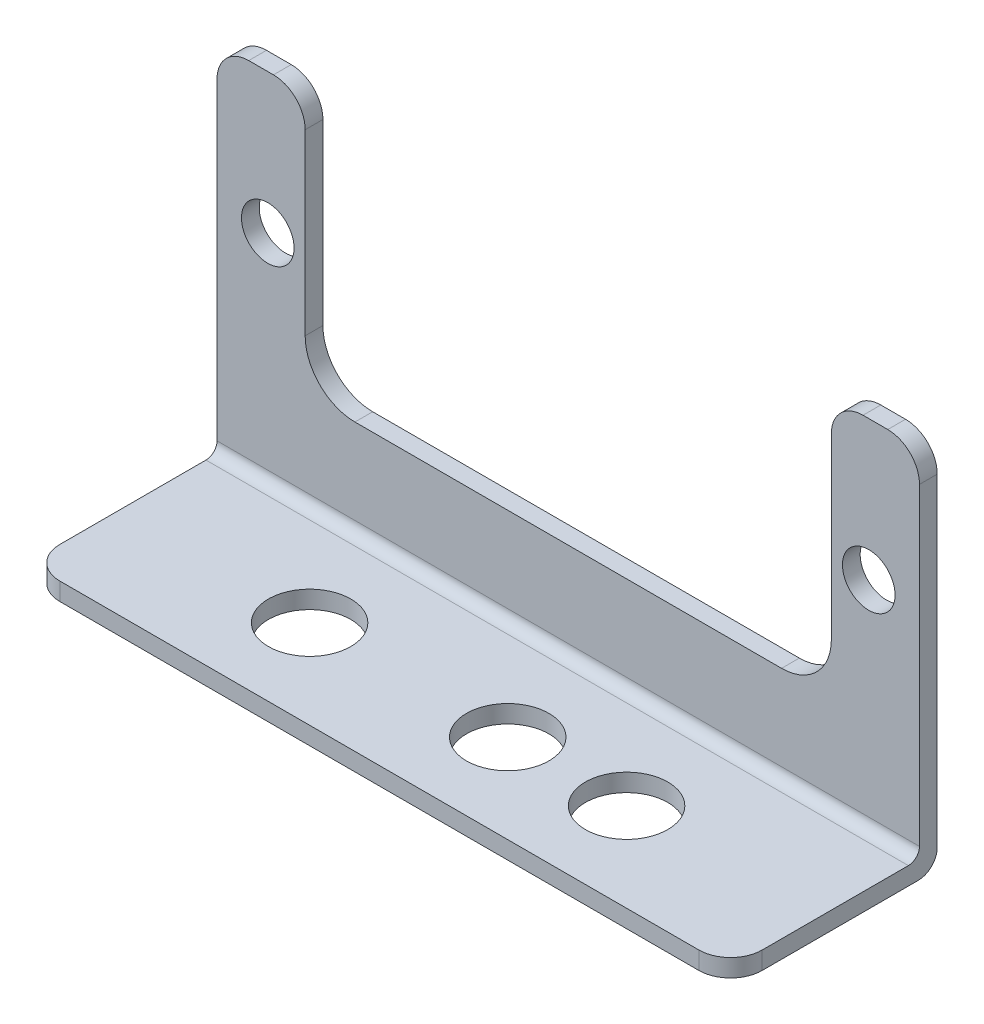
ISO-10303-21;
HEADER;
FILE_DESCRIPTION(('STEP AP214'),'2;1');
FILE_NAME('part.step','',(''),(''),'','','');
FILE_SCHEMA(('AUTOMOTIVE_DESIGN { 1 0 10303 214 1 1 1 1 }'));
ENDSEC;
DATA;
#1=APPLICATION_CONTEXT('core data for automotive mechanical design processes');
#2=APPLICATION_PROTOCOL_DEFINITION('international standard','automotive_design',2000,#1);
#3=PRODUCT_CONTEXT('',#1,'mechanical');
#4=PRODUCT('Part','Part','',(#3));
#5=PRODUCT_RELATED_PRODUCT_CATEGORY('part','',(#4));
#6=PRODUCT_DEFINITION_FORMATION('','',#4);
#7=PRODUCT_DEFINITION_CONTEXT('part definition',#1,'design');
#8=PRODUCT_DEFINITION('design','',#6,#7);
#9=PRODUCT_DEFINITION_SHAPE('','',#8);
#10=(LENGTH_UNIT() NAMED_UNIT(*) SI_UNIT(.MILLI.,.METRE.));
#11=(NAMED_UNIT(*) PLANE_ANGLE_UNIT() SI_UNIT($,.RADIAN.));
#12=(NAMED_UNIT(*) SI_UNIT($,.STERADIAN.) SOLID_ANGLE_UNIT());
#13=UNCERTAINTY_MEASURE_WITH_UNIT(LENGTH_MEASURE(1.E-05),#10,'distance_accuracy_value','');
#14=(GEOMETRIC_REPRESENTATION_CONTEXT(3) GLOBAL_UNCERTAINTY_ASSIGNED_CONTEXT((#13)) GLOBAL_UNIT_ASSIGNED_CONTEXT((#10,
#11,#12)) REPRESENTATION_CONTEXT('',''));
#15=CARTESIAN_POINT('',(0.,0.,0.));
#16=DIRECTION('',(0.,0.,1.));
#17=DIRECTION('',(1.,0.,0.));
#18=AXIS2_PLACEMENT_3D('',#15,#16,#17);
#19=CARTESIAN_POINT('',(56.2863999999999,29.9720000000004,0.));
#20=DIRECTION('',(0.,-1.,0.));
#21=DIRECTION('',(0.,0.,-1.));
#22=AXIS2_PLACEMENT_3D('',#19,#20,#21);
#23=PLANE('',#22);
#24=DIRECTION('',(-1.,0.,0.));
#25=VECTOR('',#24,1.);
#26=CARTESIAN_POINT('',(56.2863999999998,29.9720000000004,1.42240000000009));
#27=LINE('',#26,#25);
#28=CARTESIAN_POINT('',(4.5212,29.972,1.42239999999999));
#29=VERTEX_POINT('',#28);
#30=CARTESIAN_POINT('',(2.54,29.972,1.42239999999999));
#31=VERTEX_POINT('',#30);
#32=EDGE_CURVE('E289',#29,#31,#27,.T.);
#33=ORIENTED_EDGE('',*,*,#32,.F.);
#34=DIRECTION('',(0.,0.,1.));
#35=VECTOR('',#34,1.);
#36=CARTESIAN_POINT('',(4.5212,29.972,0.));
#37=LINE('',#36,#35);
#38=CARTESIAN_POINT('',(4.5212,29.972,0.));
#39=VERTEX_POINT('',#38);
#40=EDGE_CURVE('E336',#29,#39,#37,.F.);
#41=ORIENTED_EDGE('',*,*,#40,.T.);
#42=DIRECTION('',(-1.,0.,0.));
#43=VECTOR('',#42,1.);
#44=CARTESIAN_POINT('',(56.2863999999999,29.9720000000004,0.));
#45=LINE('',#44,#43);
#46=CARTESIAN_POINT('',(2.54,29.972,0.));
#47=VERTEX_POINT('',#46);
#48=EDGE_CURVE('E293',#39,#47,#45,.T.);
#49=ORIENTED_EDGE('',*,*,#48,.T.);
#50=DIRECTION('',(0.,0.,1.));
#51=VECTOR('',#50,1.);
#52=CARTESIAN_POINT('',(2.54,29.972,0.));
#53=LINE('',#52,#51);
#54=EDGE_CURVE('E333',#47,#31,#53,.T.);
#55=ORIENTED_EDGE('',*,*,#54,.T.);
#56=EDGE_LOOP('',(#33,#41,#49,#55));
#57=FACE_BOUND('',#56,.T.);
#58=ADVANCED_FACE('F44',(#57),#23,.F.);
#59=CARTESIAN_POINT('',(56.2864,0.,16.5608000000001));
#60=DIRECTION('',(0.,0.,-1.));
#61=DIRECTION('',(-1.,0.,0.));
#62=AXIS2_PLACEMENT_3D('',#59,#60,#61);
#63=PLANE('',#62);
#64=DIRECTION('',(-1.,0.,0.));
#65=VECTOR('',#64,1.);
#66=CARTESIAN_POINT('',(56.2864,0.,16.5608000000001));
#67=LINE('',#66,#65);
#68=CARTESIAN_POINT('',(53.7464,0.,16.5608));
#69=VERTEX_POINT('',#68);
#70=CARTESIAN_POINT('',(2.53999999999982,-3.60822483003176E-13,16.5608));
#71=VERTEX_POINT('',#70);
#72=EDGE_CURVE('E303',#69,#71,#67,.T.);
#73=ORIENTED_EDGE('',*,*,#72,.F.);
#74=DIRECTION('',(0.,-1.,0.));
#75=VECTOR('',#74,1.);
#76=CARTESIAN_POINT('',(53.7464,1.4224,16.5608));
#77=LINE('',#76,#75);
#78=CARTESIAN_POINT('',(53.7464,1.4224,16.5608));
#79=VERTEX_POINT('',#78);
#80=EDGE_CURVE('E351',#69,#79,#77,.F.);
#81=ORIENTED_EDGE('',*,*,#80,.T.);
#82=DIRECTION('',(-1.,0.,0.));
#83=VECTOR('',#82,1.);
#84=CARTESIAN_POINT('',(56.2864,1.4224,16.5608000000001));
#85=LINE('',#84,#83);
#86=CARTESIAN_POINT('',(2.53999999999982,1.42239999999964,16.5608));
#87=VERTEX_POINT('',#86);
#88=EDGE_CURVE('E270',#79,#87,#85,.T.);
#89=ORIENTED_EDGE('',*,*,#88,.T.);
#90=DIRECTION('',(0.,-1.,0.));
#91=VECTOR('',#90,1.);
#92=CARTESIAN_POINT('',(2.53999999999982,-3.60822483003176E-13,16.5608));
#93=LINE('',#92,#91);
#94=EDGE_CURVE('E348',#87,#71,#93,.T.);
#95=ORIENTED_EDGE('',*,*,#94,.T.);
#96=EDGE_LOOP('',(#73,#81,#89,#95));
#97=FACE_BOUND('',#96,.T.);
#98=ADVANCED_FACE('F370',(#97),#63,.F.);
#99=CARTESIAN_POINT('',(56.2864,3.60822483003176E-13,1.52400000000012));
#100=DIRECTION('',(0.,1.,0.));
#101=DIRECTION('',(0.,0.,1.));
#102=AXIS2_PLACEMENT_3D('',#99,#100,#101);
#103=PLANE('',#102);
#104=CARTESIAN_POINT('',(31.3182000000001,0.,9.44880000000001));
#105=DIRECTION('',(0.,1.,0.));
#106=DIRECTION('',(0.,0.,1.));
#107=AXIS2_PLACEMENT_3D('',#104,#105,#106);
#108=CIRCLE('',#107,3.302);
#109=CARTESIAN_POINT('',(31.3182000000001,0.,12.7508));
#110=VERTEX_POINT('',#109);
#111=EDGE_CURVE('E237',#110,#110,#108,.T.);
#112=ORIENTED_EDGE('',*,*,#111,.T.);
#113=EDGE_LOOP('',(#112));
#114=FACE_BOUND('',#113,.T.);
#115=CARTESIAN_POINT('',(40.8432000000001,3.60822483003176E-13,9.44880000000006));
#116=DIRECTION('',(0.,1.,0.));
#117=DIRECTION('',(0.,0.,1.));
#118=AXIS2_PLACEMENT_3D('',#115,#116,#117);
#119=CIRCLE('',#118,3.302);
#120=CARTESIAN_POINT('',(40.8432000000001,3.60420497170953E-13,12.7508000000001));
#121=VERTEX_POINT('',#120);
#122=EDGE_CURVE('E243',#121,#121,#119,.T.);
#123=ORIENTED_EDGE('',*,*,#122,.T.);
#124=EDGE_LOOP('',(#123));
#125=FACE_BOUND('',#124,.T.);
#126=CARTESIAN_POINT('',(15.4432,0.,9.44880000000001));
#127=DIRECTION('',(0.,1.,0.));
#128=DIRECTION('',(0.,0.,1.));
#129=AXIS2_PLACEMENT_3D('',#126,#127,#128);
#130=CIRCLE('',#129,3.302);
#131=CARTESIAN_POINT('',(15.4432,0.,12.7508));
#132=VERTEX_POINT('',#131);
#133=EDGE_CURVE('E249',#132,#132,#130,.T.);
#134=ORIENTED_EDGE('',*,*,#133,.T.);
#135=EDGE_LOOP('',(#134));
#136=FACE_BOUND('',#135,.T.);
#137=DIRECTION('',(0.,0.,-1.));
#138=VECTOR('',#137,1.);
#139=CARTESIAN_POINT('',(56.2864,3.60822483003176E-13,1.52400000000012));
#140=LINE('',#139,#138);
#141=CARTESIAN_POINT('',(56.2863999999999,3.60822483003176E-13,14.0208000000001));
#142=VERTEX_POINT('',#141);
#143=CARTESIAN_POINT('',(56.2864,3.60822483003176E-13,1.52400000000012));
#144=VERTEX_POINT('',#143);
#145=EDGE_CURVE('E255',#142,#144,#140,.T.);
#146=ORIENTED_EDGE('',*,*,#145,.F.);
#147=CARTESIAN_POINT('',(53.7464,0.,14.0208));
#148=DIRECTION('',(0.,1.,0.));
#149=DIRECTION('',(0.,0.,1.));
#150=AXIS2_PLACEMENT_3D('',#147,#148,#149);
#151=CIRCLE('',#150,2.54);
#152=EDGE_CURVE('E346',#142,#69,#151,.F.);
#153=ORIENTED_EDGE('',*,*,#152,.T.);
#154=ORIENTED_EDGE('',*,*,#72,.T.);
#155=CARTESIAN_POINT('',(2.54,0.,14.0208));
#156=DIRECTION('',(0.,1.,0.));
#157=DIRECTION('',(0.,0.,1.));
#158=AXIS2_PLACEMENT_3D('',#155,#156,#157);
#159=CIRCLE('',#158,2.54);
#160=CARTESIAN_POINT('',(0.,0.,14.0208));
#161=VERTEX_POINT('',#160);
#162=EDGE_CURVE('E344',#71,#161,#159,.F.);
#163=ORIENTED_EDGE('',*,*,#162,.T.);
#164=DIRECTION('',(0.,0.,-1.));
#165=VECTOR('',#164,1.);
#166=CARTESIAN_POINT('',(0.,0.,1.524));
#167=LINE('',#166,#165);
#168=CARTESIAN_POINT('',(0.,0.,1.524));
#169=VERTEX_POINT('',#168);
#170=EDGE_CURVE('E252',#161,#169,#167,.T.);
#171=ORIENTED_EDGE('',*,*,#170,.T.);
#172=DIRECTION('',(-1.,0.,0.));
#173=VECTOR('',#172,1.);
#174=CARTESIAN_POINT('',(56.2864,3.60822483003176E-13,1.52400000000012));
#175=LINE('',#174,#173);
#176=EDGE_CURVE('E300',#144,#169,#175,.T.);
#177=ORIENTED_EDGE('',*,*,#176,.F.);
#178=EDGE_LOOP('',(#146,#153,#154,#163,#171,#177));
#179=FACE_BOUND('',#178,.T.);
#180=ADVANCED_FACE('F367',(#114,#125,#136,#179),#103,.F.);
#181=CARTESIAN_POINT('',(56.2864,1.52400000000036,1.52400000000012));
#182=DIRECTION('',(-1.,0.,0.));
#183=DIRECTION('',(0.,0.,1.));
#184=AXIS2_PLACEMENT_3D('',#181,#182,#183);
#185=CYLINDRICAL_SURFACE('',#184,1.524);
#186=CARTESIAN_POINT('',(0.,1.524,1.524));
#187=DIRECTION('',(1.,0.,0.));
#188=DIRECTION('',(0.,0.,1.));
#189=AXIS2_PLACEMENT_3D('',#186,#187,#188);
#190=CIRCLE('',#189,1.524);
#191=CARTESIAN_POINT('',(0.,1.52400000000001,0.));
#192=VERTEX_POINT('',#191);
#193=EDGE_CURVE('E272',#169,#192,#190,.T.);
#194=ORIENTED_EDGE('',*,*,#193,.T.);
#195=DIRECTION('',(-1.,0.,0.));
#196=VECTOR('',#195,1.);
#197=CARTESIAN_POINT('',(56.2864,1.52400000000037,0.));
#198=LINE('',#197,#196);
#199=CARTESIAN_POINT('',(56.2864,1.52400000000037,0.));
#200=VERTEX_POINT('',#199);
#201=EDGE_CURVE('E297',#200,#192,#198,.T.);
#202=ORIENTED_EDGE('',*,*,#201,.F.);
#203=CARTESIAN_POINT('',(56.2864,1.52400000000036,1.52400000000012));
#204=DIRECTION('',(1.,0.,0.));
#205=DIRECTION('',(0.,0.,1.));
#206=AXIS2_PLACEMENT_3D('',#203,#204,#205);
#207=CIRCLE('',#206,1.524);
#208=EDGE_CURVE('E257',#144,#200,#207,.T.);
#209=ORIENTED_EDGE('',*,*,#208,.F.);
#210=ORIENTED_EDGE('',*,*,#176,.T.);
#211=EDGE_LOOP('',(#194,#202,#209,#210));
#212=FACE_BOUND('',#211,.T.);
#213=ADVANCED_FACE('F378',(#212),#185,.T.);
#214=CARTESIAN_POINT('',(56.2864,1.52400000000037,0.));
#215=DIRECTION('',(0.,0.,1.));
#216=DIRECTION('',(1.,0.,0.));
#217=AXIS2_PLACEMENT_3D('',#214,#215,#216);
#218=PLANE('',#217);
#219=CARTESIAN_POINT('',(52.2224,18.7706,0.));
#220=DIRECTION('',(0.,0.,1.));
#221=DIRECTION('',(1.,0.,0.));
#222=AXIS2_PLACEMENT_3D('',#219,#220,#221);
#223=CIRCLE('',#222,2.1082);
#224=CARTESIAN_POINT('',(54.3306,18.7706,0.));
#225=VERTEX_POINT('',#224);
#226=EDGE_CURVE('E678',#225,#225,#223,.T.);
#227=ORIENTED_EDGE('',*,*,#226,.T.);
#228=EDGE_LOOP('',(#227));
#229=FACE_BOUND('',#228,.T.);
#230=CARTESIAN_POINT('',(4.064,18.7706,0.));
#231=DIRECTION('',(0.,0.,1.));
#232=DIRECTION('',(1.,0.,0.));
#233=AXIS2_PLACEMENT_3D('',#230,#231,#232);
#234=CIRCLE('',#233,2.1082);
#235=CARTESIAN_POINT('',(6.1722,18.7706,0.));
#236=VERTEX_POINT('',#235);
#237=EDGE_CURVE('E224',#236,#236,#234,.T.);
#238=ORIENTED_EDGE('',*,*,#237,.T.);
#239=EDGE_LOOP('',(#238));
#240=FACE_BOUND('',#239,.T.);
#241=CARTESIAN_POINT('',(53.7464,29.972,0.));
#242=VERTEX_POINT('',#241);
#243=CARTESIAN_POINT('',(51.7651999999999,29.972,0.));
#244=VERTEX_POINT('',#243);
#245=EDGE_CURVE('E296',#242,#244,#45,.T.);
#246=ORIENTED_EDGE('',*,*,#245,.F.);
#247=CARTESIAN_POINT('',(53.7464,27.432,0.));
#248=DIRECTION('',(0.,0.,1.));
#249=DIRECTION('',(1.,0.,0.));
#250=AXIS2_PLACEMENT_3D('',#247,#248,#249);
#251=CIRCLE('',#250,2.54);
#252=CARTESIAN_POINT('',(56.2864,27.4320000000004,0.));
#253=VERTEX_POINT('',#252);
#254=EDGE_CURVE('E328',#242,#253,#251,.F.);
#255=ORIENTED_EDGE('',*,*,#254,.T.);
#256=DIRECTION('',(0.,1.,0.));
#257=VECTOR('',#256,1.);
#258=CARTESIAN_POINT('',(56.2864,1.52400000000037,0.));
#259=LINE('',#258,#257);
#260=EDGE_CURVE('E260',#200,#253,#259,.T.);
#261=ORIENTED_EDGE('',*,*,#260,.F.);
#262=ORIENTED_EDGE('',*,*,#201,.T.);
#263=DIRECTION('',(0.,1.,0.));
#264=VECTOR('',#263,1.);
#265=CARTESIAN_POINT('',(0.,1.52400000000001,0.));
#266=LINE('',#265,#264);
#267=CARTESIAN_POINT('',(0.,27.432,0.));
#268=VERTEX_POINT('',#267);
#269=EDGE_CURVE('E274',#192,#268,#266,.T.);
#270=ORIENTED_EDGE('',*,*,#269,.T.);
#271=CARTESIAN_POINT('',(2.54,27.432,0.));
#272=DIRECTION('',(0.,0.,1.));
#273=DIRECTION('',(1.,0.,0.));
#274=AXIS2_PLACEMENT_3D('',#271,#272,#273);
#275=CIRCLE('',#274,2.54);
#276=EDGE_CURVE('E322',#268,#47,#275,.F.);
#277=ORIENTED_EDGE('',*,*,#276,.T.);
#278=ORIENTED_EDGE('',*,*,#48,.F.);
#279=CARTESIAN_POINT('',(4.5212,27.432,0.));
#280=DIRECTION('',(0.,0.,1.));
#281=DIRECTION('',(1.,0.,0.));
#282=AXIS2_PLACEMENT_3D('',#279,#280,#281);
#283=CIRCLE('',#282,2.54);
#284=CARTESIAN_POINT('',(7.0612,27.432,0.));
#285=VERTEX_POINT('',#284);
#286=EDGE_CURVE('E326',#39,#285,#283,.F.);
#287=ORIENTED_EDGE('',*,*,#286,.T.);
#288=DIRECTION('',(0.,-1.,0.));
#289=VECTOR('',#288,1.);
#290=CARTESIAN_POINT('',(7.0612,13.1318000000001,0.));
#291=LINE('',#290,#289);
#292=CARTESIAN_POINT('',(7.0612,13.1318000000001,0.));
#293=VERTEX_POINT('',#292);
#294=EDGE_CURVE('E203',#285,#293,#291,.T.);
#295=ORIENTED_EDGE('',*,*,#294,.T.);
#296=CARTESIAN_POINT('',(11.049,13.1318000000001,0.));
#297=DIRECTION('',(0.,0.,1.));
#298=DIRECTION('',(-1.,0.,0.));
#299=AXIS2_PLACEMENT_3D('',#296,#297,#298);
#300=CIRCLE('',#299,3.9878);
#301=CARTESIAN_POINT('',(11.049,9.14400000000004,0.));
#302=VERTEX_POINT('',#301);
#303=EDGE_CURVE('E219',#293,#302,#300,.T.);
#304=ORIENTED_EDGE('',*,*,#303,.T.);
#305=DIRECTION('',(1.,0.,0.));
#306=VECTOR('',#305,1.);
#307=CARTESIAN_POINT('',(28.1432,9.144,0.));
#308=LINE('',#307,#306);
#309=CARTESIAN_POINT('',(45.2374,9.144,0.));
#310=VERTEX_POINT('',#309);
#311=EDGE_CURVE('E194',#302,#310,#308,.T.);
#312=ORIENTED_EDGE('',*,*,#311,.T.);
#313=CARTESIAN_POINT('',(45.2374,13.1318,0.));
#314=DIRECTION('',(0.,0.,1.));
#315=DIRECTION('',(-1.,0.,0.));
#316=AXIS2_PLACEMENT_3D('',#313,#314,#315);
#317=CIRCLE('',#316,3.9878);
#318=CARTESIAN_POINT('',(49.2252,13.1318,0.));
#319=VERTEX_POINT('',#318);
#320=EDGE_CURVE('E186',#310,#319,#317,.T.);
#321=ORIENTED_EDGE('',*,*,#320,.T.);
#322=DIRECTION('',(0.,1.,0.));
#323=VECTOR('',#322,1.);
#324=CARTESIAN_POINT('',(49.2252,29.972,0.));
#325=LINE('',#324,#323);
#326=CARTESIAN_POINT('',(49.2252,27.432,0.));
#327=VERTEX_POINT('',#326);
#328=EDGE_CURVE('E197',#319,#327,#325,.T.);
#329=ORIENTED_EDGE('',*,*,#328,.T.);
#330=CARTESIAN_POINT('',(51.7652,27.432,0.));
#331=DIRECTION('',(0.,0.,1.));
#332=DIRECTION('',(1.,0.,0.));
#333=AXIS2_PLACEMENT_3D('',#330,#331,#332);
#334=CIRCLE('',#333,2.54);
#335=EDGE_CURVE('E324',#327,#244,#334,.F.);
#336=ORIENTED_EDGE('',*,*,#335,.T.);
#337=EDGE_LOOP('',(#246,#255,#261,#262,#270,#277,#278,#287,#295,#304,#312,#321,#329,#336));
#338=FACE_BOUND('',#337,.T.);
#339=ADVANCED_FACE('F206',(#229,#240,#338),#218,.F.);
#340=CARTESIAN_POINT('',(53.7463999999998,29.972,1.42240000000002));
#341=VERTEX_POINT('',#340);
#342=CARTESIAN_POINT('',(51.7651999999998,29.972,1.42240000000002));
#343=VERTEX_POINT('',#342);
#344=EDGE_CURVE('E290',#341,#343,#27,.T.);
#345=ORIENTED_EDGE('',*,*,#344,.F.);
#346=DIRECTION('',(0.,0.,1.));
#347=VECTOR('',#346,1.);
#348=CARTESIAN_POINT('',(53.7464,29.972,0.));
#349=LINE('',#348,#347);
#350=EDGE_CURVE('E320',#341,#242,#349,.F.);
#351=ORIENTED_EDGE('',*,*,#350,.T.);
#352=ORIENTED_EDGE('',*,*,#245,.T.);
#353=DIRECTION('',(0.,0.,1.));
#354=VECTOR('',#353,1.);
#355=CARTESIAN_POINT('',(51.7651999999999,29.972,0.));
#356=LINE('',#355,#354);
#357=EDGE_CURVE('E317',#244,#343,#356,.T.);
#358=ORIENTED_EDGE('',*,*,#357,.T.);
#359=EDGE_LOOP('',(#345,#351,#352,#358));
#360=FACE_BOUND('',#359,.T.);
#361=ADVANCED_FACE('F393',(#360),#23,.F.);
#362=CARTESIAN_POINT('',(56.2863999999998,29.9720000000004,1.42240000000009));
#363=DIRECTION('',(0.,0.,-1.));
#364=DIRECTION('',(-1.,0.,0.));
#365=AXIS2_PLACEMENT_3D('',#362,#363,#364);
#366=PLANE('',#365);
#367=CARTESIAN_POINT('',(52.2223999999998,18.7706,1.42239999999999));
#368=DIRECTION('',(0.,0.,1.));
#369=DIRECTION('',(1.,0.,0.));
#370=AXIS2_PLACEMENT_3D('',#367,#368,#369);
#371=CIRCLE('',#370,2.1082);
#372=CARTESIAN_POINT('',(54.3305999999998,18.7706,1.42239999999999));
#373=VERTEX_POINT('',#372);
#374=EDGE_CURVE('E679',#373,#373,#371,.T.);
#375=ORIENTED_EDGE('',*,*,#374,.F.);
#376=EDGE_LOOP('',(#375));
#377=FACE_BOUND('',#376,.T.);
#378=CARTESIAN_POINT('',(4.064,18.7706,1.42240000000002));
#379=DIRECTION('',(0.,0.,1.));
#380=DIRECTION('',(1.,0.,0.));
#381=AXIS2_PLACEMENT_3D('',#378,#379,#380);
#382=CIRCLE('',#381,2.1082);
#383=CARTESIAN_POINT('',(6.1722,18.7706,1.42240000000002));
#384=VERTEX_POINT('',#383);
#385=EDGE_CURVE('E215',#384,#384,#382,.T.);
#386=ORIENTED_EDGE('',*,*,#385,.F.);
#387=EDGE_LOOP('',(#386));
#388=FACE_BOUND('',#387,.T.);
#389=DIRECTION('',(0.,-1.,0.));
#390=VECTOR('',#389,1.);
#391=CARTESIAN_POINT('',(56.2863999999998,29.9720000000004,1.42240000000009));
#392=LINE('',#391,#390);
#393=CARTESIAN_POINT('',(56.2863999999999,27.4320000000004,1.42240000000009));
#394=VERTEX_POINT('',#393);
#395=CARTESIAN_POINT('',(56.2863999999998,2.31140000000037,1.42240000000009));
#396=VERTEX_POINT('',#395);
#397=EDGE_CURVE('E263',#394,#396,#392,.T.);
#398=ORIENTED_EDGE('',*,*,#397,.F.);
#399=CARTESIAN_POINT('',(53.7463999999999,27.432,1.42240000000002));
#400=DIRECTION('',(0.,0.,-1.));
#401=DIRECTION('',(-1.,0.,0.));
#402=AXIS2_PLACEMENT_3D('',#399,#400,#401);
#403=CIRCLE('',#402,2.54);
#404=EDGE_CURVE('E315',#394,#341,#403,.F.);
#405=ORIENTED_EDGE('',*,*,#404,.T.);
#406=ORIENTED_EDGE('',*,*,#344,.T.);
#407=CARTESIAN_POINT('',(51.7651999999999,27.432,1.42240000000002));
#408=DIRECTION('',(0.,0.,-1.));
#409=DIRECTION('',(-1.,0.,0.));
#410=AXIS2_PLACEMENT_3D('',#407,#408,#409);
#411=CIRCLE('',#410,2.54);
#412=CARTESIAN_POINT('',(49.2251999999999,27.432,1.42240000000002));
#413=VERTEX_POINT('',#412);
#414=EDGE_CURVE('E311',#343,#413,#411,.F.);
#415=ORIENTED_EDGE('',*,*,#414,.T.);
#416=DIRECTION('',(0.,1.,0.));
#417=VECTOR('',#416,1.);
#418=CARTESIAN_POINT('',(49.2251999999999,29.9720000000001,1.42240000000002));
#419=LINE('',#418,#417);
#420=CARTESIAN_POINT('',(49.2251999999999,13.1318000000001,1.42240000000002));
#421=VERTEX_POINT('',#420);
#422=EDGE_CURVE('E223',#421,#413,#419,.T.);
#423=ORIENTED_EDGE('',*,*,#422,.F.);
#424=CARTESIAN_POINT('',(45.2373999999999,13.1318000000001,1.42240000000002));
#425=DIRECTION('',(0.,0.,1.));
#426=DIRECTION('',(-1.,0.,0.));
#427=AXIS2_PLACEMENT_3D('',#424,#425,#426);
#428=CIRCLE('',#427,3.9878);
#429=CARTESIAN_POINT('',(45.2373999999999,9.14400000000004,1.42240000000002));
#430=VERTEX_POINT('',#429);
#431=EDGE_CURVE('E189',#430,#421,#428,.T.);
#432=ORIENTED_EDGE('',*,*,#431,.F.);
#433=DIRECTION('',(1.,0.,0.));
#434=VECTOR('',#433,1.);
#435=CARTESIAN_POINT('',(45.2373999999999,9.14400000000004,1.42240000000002));
#436=LINE('',#435,#434);
#437=CARTESIAN_POINT('',(11.049,9.14400000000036,1.42240000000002));
#438=VERTEX_POINT('',#437);
#439=EDGE_CURVE('E209',#438,#430,#436,.T.);
#440=ORIENTED_EDGE('',*,*,#439,.F.);
#441=CARTESIAN_POINT('',(11.049,13.1318000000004,1.42240000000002));
#442=DIRECTION('',(0.,0.,1.));
#443=DIRECTION('',(-1.,0.,0.));
#444=AXIS2_PLACEMENT_3D('',#441,#442,#443);
#445=CIRCLE('',#444,3.9878);
#446=CARTESIAN_POINT('',(7.0612,13.1318000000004,1.42240000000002));
#447=VERTEX_POINT('',#446);
#448=EDGE_CURVE('E212',#447,#438,#445,.T.);
#449=ORIENTED_EDGE('',*,*,#448,.F.);
#450=DIRECTION('',(0.,-1.,0.));
#451=VECTOR('',#450,1.);
#452=CARTESIAN_POINT('',(7.0612,13.1318000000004,1.42240000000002));
#453=LINE('',#452,#451);
#454=CARTESIAN_POINT('',(7.0612,27.4320000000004,1.42240000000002));
#455=VERTEX_POINT('',#454);
#456=EDGE_CURVE('E226',#455,#447,#453,.T.);
#457=ORIENTED_EDGE('',*,*,#456,.F.);
#458=CARTESIAN_POINT('',(4.5212,27.432,1.42239999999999));
#459=DIRECTION('',(0.,0.,-1.));
#460=DIRECTION('',(-1.,0.,0.));
#461=AXIS2_PLACEMENT_3D('',#458,#459,#460);
#462=CIRCLE('',#461,2.54);
#463=EDGE_CURVE('E313',#455,#29,#462,.F.);
#464=ORIENTED_EDGE('',*,*,#463,.T.);
#465=ORIENTED_EDGE('',*,*,#32,.T.);
#466=CARTESIAN_POINT('',(2.54,27.432,1.42239999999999));
#467=DIRECTION('',(0.,0.,-1.));
#468=DIRECTION('',(-1.,0.,0.));
#469=AXIS2_PLACEMENT_3D('',#466,#467,#468);
#470=CIRCLE('',#469,2.54);
#471=CARTESIAN_POINT('',(0.,27.432,1.42240000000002));
#472=VERTEX_POINT('',#471);
#473=EDGE_CURVE('E309',#31,#472,#470,.F.);
#474=ORIENTED_EDGE('',*,*,#473,.T.);
#475=DIRECTION('',(0.,-1.,0.));
#476=VECTOR('',#475,1.);
#477=CARTESIAN_POINT('',(0.,29.972,1.42240000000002));
#478=LINE('',#477,#476);
#479=CARTESIAN_POINT('',(0.,2.31140000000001,1.42240000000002));
#480=VERTEX_POINT('',#479);
#481=EDGE_CURVE('E277',#472,#480,#478,.T.);
#482=ORIENTED_EDGE('',*,*,#481,.T.);
#483=DIRECTION('',(-1.,0.,0.));
#484=VECTOR('',#483,1.);
#485=CARTESIAN_POINT('',(56.2863999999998,2.31140000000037,1.42240000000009));
#486=LINE('',#485,#484);
#487=EDGE_CURVE('E286',#396,#480,#486,.T.);
#488=ORIENTED_EDGE('',*,*,#487,.F.);
#489=EDGE_LOOP('',(#398,#405,#406,#415,#423,#432,#440,#449,#457,#464,#465,#474,#482,#488));
#490=FACE_BOUND('',#489,.T.);
#491=ADVANCED_FACE('F390',(#377,#388,#490),#366,.F.);
#492=CARTESIAN_POINT('',(56.2863999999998,2.31140000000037,2.31140000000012));
#493=DIRECTION('',(-1.,0.,0.));
#494=DIRECTION('',(0.,0.,1.));
#495=AXIS2_PLACEMENT_3D('',#492,#493,#494);
#496=CYLINDRICAL_SURFACE('',#495,0.889);
#497=CARTESIAN_POINT('',(-1.80411241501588E-13,2.31140000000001,2.31139999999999));
#498=DIRECTION('',(-1.,0.,0.));
#499=DIRECTION('',(0.,0.,-1.));
#500=AXIS2_PLACEMENT_3D('',#497,#498,#499);
#501=CIRCLE('',#500,0.889);
#502=CARTESIAN_POINT('',(-1.80411241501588E-13,1.4224,2.31139999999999));
#503=VERTEX_POINT('',#502);
#504=EDGE_CURVE('E279',#480,#503,#501,.T.);
#505=ORIENTED_EDGE('',*,*,#504,.T.);
#506=DIRECTION('',(-1.,0.,0.));
#507=VECTOR('',#506,1.);
#508=CARTESIAN_POINT('',(56.2863999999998,1.42240000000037,2.31140000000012));
#509=LINE('',#508,#507);
#510=CARTESIAN_POINT('',(56.2863999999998,1.42240000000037,2.31140000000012));
#511=VERTEX_POINT('',#510);
#512=EDGE_CURVE('E283',#511,#503,#509,.T.);
#513=ORIENTED_EDGE('',*,*,#512,.F.);
#514=CARTESIAN_POINT('',(56.2863999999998,2.31140000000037,2.31140000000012));
#515=DIRECTION('',(-1.,0.,0.));
#516=DIRECTION('',(0.,0.,-1.));
#517=AXIS2_PLACEMENT_3D('',#514,#515,#516);
#518=CIRCLE('',#517,0.889);
#519=EDGE_CURVE('E265',#396,#511,#518,.T.);
#520=ORIENTED_EDGE('',*,*,#519,.F.);
#521=ORIENTED_EDGE('',*,*,#487,.T.);
#522=EDGE_LOOP('',(#505,#513,#520,#521));
#523=FACE_BOUND('',#522,.T.);
#524=ADVANCED_FACE('F426',(#523),#496,.F.);
#525=CARTESIAN_POINT('',(56.2864,1.4224,16.5608000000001));
#526=DIRECTION('',(0.,-1.,0.));
#527=DIRECTION('',(0.,0.,-1.));
#528=AXIS2_PLACEMENT_3D('',#525,#526,#527);
#529=PLANE('',#528);
#530=CARTESIAN_POINT('',(31.3182000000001,1.4224,9.44880000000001));
#531=DIRECTION('',(0.,1.,0.));
#532=DIRECTION('',(0.,0.,1.));
#533=AXIS2_PLACEMENT_3D('',#530,#531,#532);
#534=CIRCLE('',#533,3.302);
#535=CARTESIAN_POINT('',(31.3182000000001,1.4224,12.7508));
#536=VERTEX_POINT('',#535);
#537=EDGE_CURVE('E232',#536,#536,#534,.T.);
#538=ORIENTED_EDGE('',*,*,#537,.F.);
#539=EDGE_LOOP('',(#538));
#540=FACE_BOUND('',#539,.T.);
#541=CARTESIAN_POINT('',(40.8432000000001,1.42240000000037,9.44880000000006));
#542=DIRECTION('',(0.,1.,0.));
#543=DIRECTION('',(0.,0.,1.));
#544=AXIS2_PLACEMENT_3D('',#541,#542,#543);
#545=CIRCLE('',#544,3.302);
#546=CARTESIAN_POINT('',(40.8432000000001,1.42240000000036,12.7508000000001));
#547=VERTEX_POINT('',#546);
#548=EDGE_CURVE('E240',#547,#547,#545,.T.);
#549=ORIENTED_EDGE('',*,*,#548,.F.);
#550=EDGE_LOOP('',(#549));
#551=FACE_BOUND('',#550,.T.);
#552=CARTESIAN_POINT('',(15.4432,1.4224,9.44880000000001));
#553=DIRECTION('',(0.,1.,0.));
#554=DIRECTION('',(0.,0.,1.));
#555=AXIS2_PLACEMENT_3D('',#552,#553,#554);
#556=CIRCLE('',#555,3.302);
#557=CARTESIAN_POINT('',(15.4432,1.4224,12.7508));
#558=VERTEX_POINT('',#557);
#559=EDGE_CURVE('E246',#558,#558,#556,.T.);
#560=ORIENTED_EDGE('',*,*,#559,.F.);
#561=EDGE_LOOP('',(#560));
#562=FACE_BOUND('',#561,.T.);
#563=ORIENTED_EDGE('',*,*,#88,.F.);
#564=CARTESIAN_POINT('',(53.7463999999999,1.4224,14.0208));
#565=DIRECTION('',(0.,-1.,0.));
#566=DIRECTION('',(0.,0.,-1.));
#567=AXIS2_PLACEMENT_3D('',#564,#565,#566);
#568=CIRCLE('',#567,2.54);
#569=CARTESIAN_POINT('',(56.2863999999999,1.42240000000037,14.0208000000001));
#570=VERTEX_POINT('',#569);
#571=EDGE_CURVE('E52',#79,#570,#568,.F.);
#572=ORIENTED_EDGE('',*,*,#571,.T.);
#573=DIRECTION('',(0.,0.,1.));
#574=VECTOR('',#573,1.);
#575=CARTESIAN_POINT('',(56.2864,1.4224,16.5608000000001));
#576=LINE('',#575,#574);
#577=EDGE_CURVE('E267',#511,#570,#576,.T.);
#578=ORIENTED_EDGE('',*,*,#577,.F.);
#579=ORIENTED_EDGE('',*,*,#512,.T.);
#580=DIRECTION('',(0.,0.,1.));
#581=VECTOR('',#580,1.);
#582=CARTESIAN_POINT('',(-1.80411241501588E-13,1.4224,16.5608));
#583=LINE('',#582,#581);
#584=CARTESIAN_POINT('',(0.,1.4224,14.0208));
#585=VERTEX_POINT('',#584);
#586=EDGE_CURVE('E258',#503,#585,#583,.T.);
#587=ORIENTED_EDGE('',*,*,#586,.T.);
#588=CARTESIAN_POINT('',(2.54,1.4224,14.0208));
#589=DIRECTION('',(0.,-1.,0.));
#590=DIRECTION('',(0.,0.,-1.));
#591=AXIS2_PLACEMENT_3D('',#588,#589,#590);
#592=CIRCLE('',#591,2.54);
#593=EDGE_CURVE('E64',#585,#87,#592,.F.);
#594=ORIENTED_EDGE('',*,*,#593,.T.);
#595=EDGE_LOOP('',(#563,#572,#578,#579,#587,#594));
#596=FACE_BOUND('',#595,.T.);
#597=ADVANCED_FACE('F355',(#540,#551,#562,#596),#529,.F.);
#598=CARTESIAN_POINT('',(56.2863999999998,2.31140000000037,2.31140000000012));
#599=DIRECTION('',(1.,0.,0.));
#600=DIRECTION('',(0.,0.,-1.));
#601=AXIS2_PLACEMENT_3D('',#598,#599,#600);
#602=PLANE('',#601);
#603=ORIENTED_EDGE('',*,*,#577,.T.);
#604=DIRECTION('',(0.,-1.,0.));
#605=VECTOR('',#604,1.);
#606=CARTESIAN_POINT('',(56.2863999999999,3.60822483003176E-13,14.0208000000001));
#607=LINE('',#606,#605);
#608=EDGE_CURVE('E341',#570,#142,#607,.T.);
#609=ORIENTED_EDGE('',*,*,#608,.T.);
#610=ORIENTED_EDGE('',*,*,#145,.T.);
#611=ORIENTED_EDGE('',*,*,#208,.T.);
#612=ORIENTED_EDGE('',*,*,#260,.T.);
#613=DIRECTION('',(0.,0.,1.));
#614=VECTOR('',#613,1.);
#615=CARTESIAN_POINT('',(56.2863999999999,27.4320000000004,1.42240000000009));
#616=LINE('',#615,#614);
#617=EDGE_CURVE('E306',#253,#394,#616,.T.);
#618=ORIENTED_EDGE('',*,*,#617,.T.);
#619=ORIENTED_EDGE('',*,*,#397,.T.);
#620=ORIENTED_EDGE('',*,*,#519,.T.);
#621=EDGE_LOOP('',(#603,#609,#610,#611,#612,#618,#619,#620));
#622=FACE_BOUND('',#621,.T.);
#623=ADVANCED_FACE('F360',(#622),#602,.T.);
#624=CARTESIAN_POINT('',(-1.80411241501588E-13,2.31140000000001,2.31139999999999));
#625=DIRECTION('',(1.,0.,0.));
#626=DIRECTION('',(0.,0.,-1.));
#627=AXIS2_PLACEMENT_3D('',#624,#625,#626);
#628=PLANE('',#627);
#629=ORIENTED_EDGE('',*,*,#170,.F.);
#630=DIRECTION('',(0.,-1.,0.));
#631=VECTOR('',#630,1.);
#632=CARTESIAN_POINT('',(0.,2.31140000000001,14.0208));
#633=LINE('',#632,#631);
#634=EDGE_CURVE('E13',#161,#585,#633,.F.);
#635=ORIENTED_EDGE('',*,*,#634,.T.);
#636=ORIENTED_EDGE('',*,*,#586,.F.);
#637=ORIENTED_EDGE('',*,*,#504,.F.);
#638=ORIENTED_EDGE('',*,*,#481,.F.);
#639=DIRECTION('',(0.,0.,1.));
#640=VECTOR('',#639,1.);
#641=CARTESIAN_POINT('',(-1.80411241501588E-13,27.432,2.31139999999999));
#642=LINE('',#641,#640);
#643=EDGE_CURVE('E339',#472,#268,#642,.F.);
#644=ORIENTED_EDGE('',*,*,#643,.T.);
#645=ORIENTED_EDGE('',*,*,#269,.F.);
#646=ORIENTED_EDGE('',*,*,#193,.F.);
#647=EDGE_LOOP('',(#629,#635,#636,#637,#638,#644,#645,#646));
#648=FACE_BOUND('',#647,.T.);
#649=ADVANCED_FACE('F374',(#648),#628,.F.);
#650=CARTESIAN_POINT('',(15.4432,0.,9.44880000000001));
#651=DIRECTION('',(0.,1.,0.));
#652=DIRECTION('',(0.,0.,1.));
#653=AXIS2_PLACEMENT_3D('',#650,#651,#652);
#654=CYLINDRICAL_SURFACE('',#653,3.302);
#655=ORIENTED_EDGE('',*,*,#133,.F.);
#656=EDGE_LOOP('',(#655));
#657=FACE_BOUND('',#656,.T.);
#658=ORIENTED_EDGE('',*,*,#559,.T.);
#659=EDGE_LOOP('',(#658));
#660=FACE_BOUND('',#659,.T.);
#661=ADVANCED_FACE('F502',(#657,#660),#654,.F.);
#662=CARTESIAN_POINT('',(40.8432000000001,3.60822483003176E-13,9.44880000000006));
#663=DIRECTION('',(0.,1.,0.));
#664=DIRECTION('',(0.,0.,1.));
#665=AXIS2_PLACEMENT_3D('',#662,#663,#664);
#666=CYLINDRICAL_SURFACE('',#665,3.302);
#667=ORIENTED_EDGE('',*,*,#122,.F.);
#668=EDGE_LOOP('',(#667));
#669=FACE_BOUND('',#668,.T.);
#670=ORIENTED_EDGE('',*,*,#548,.T.);
#671=EDGE_LOOP('',(#670));
#672=FACE_BOUND('',#671,.T.);
#673=ADVANCED_FACE('F498',(#669,#672),#666,.F.);
#674=CARTESIAN_POINT('',(31.3182000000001,0.,9.44880000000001));
#675=DIRECTION('',(0.,1.,0.));
#676=DIRECTION('',(0.,0.,1.));
#677=AXIS2_PLACEMENT_3D('',#674,#675,#676);
#678=CYLINDRICAL_SURFACE('',#677,3.302);
#679=ORIENTED_EDGE('',*,*,#111,.F.);
#680=EDGE_LOOP('',(#679));
#681=FACE_BOUND('',#680,.T.);
#682=ORIENTED_EDGE('',*,*,#537,.T.);
#683=EDGE_LOOP('',(#682));
#684=FACE_BOUND('',#683,.T.);
#685=ADVANCED_FACE('F495',(#681,#684),#678,.F.);
#686=CARTESIAN_POINT('',(45.2374,13.1318,0.));
#687=DIRECTION('',(0.,0.,1.));
#688=DIRECTION('',(1.,0.,0.));
#689=AXIS2_PLACEMENT_3D('',#686,#687,#688);
#690=CYLINDRICAL_SURFACE('',#689,3.9878);
#691=ORIENTED_EDGE('',*,*,#431,.T.);
#692=DIRECTION('',(0.,0.,1.));
#693=VECTOR('',#692,1.);
#694=CARTESIAN_POINT('',(49.2252,13.1318,0.));
#695=LINE('',#694,#693);
#696=EDGE_CURVE('E182',#319,#421,#695,.T.);
#697=ORIENTED_EDGE('',*,*,#696,.F.);
#698=ORIENTED_EDGE('',*,*,#320,.F.);
#699=DIRECTION('',(0.,0.,1.));
#700=VECTOR('',#699,1.);
#701=CARTESIAN_POINT('',(45.2374,9.144,0.));
#702=LINE('',#701,#700);
#703=EDGE_CURVE('E230',#310,#430,#702,.T.);
#704=ORIENTED_EDGE('',*,*,#703,.T.);
#705=EDGE_LOOP('',(#691,#697,#698,#704));
#706=FACE_BOUND('',#705,.T.);
#707=ADVANCED_FACE('F184',(#706),#690,.F.);
#708=CARTESIAN_POINT('',(45.2374,9.144,0.));
#709=DIRECTION('',(0.,-1.,0.));
#710=DIRECTION('',(1.,0.,0.));
#711=AXIS2_PLACEMENT_3D('',#708,#709,#710);
#712=PLANE('',#711);
#713=ORIENTED_EDGE('',*,*,#439,.T.);
#714=ORIENTED_EDGE('',*,*,#703,.F.);
#715=ORIENTED_EDGE('',*,*,#311,.F.);
#716=DIRECTION('',(0.,0.,1.));
#717=VECTOR('',#716,1.);
#718=CARTESIAN_POINT('',(11.049,9.14400000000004,0.));
#719=LINE('',#718,#717);
#720=EDGE_CURVE('E233',#302,#438,#719,.T.);
#721=ORIENTED_EDGE('',*,*,#720,.T.);
#722=EDGE_LOOP('',(#713,#714,#715,#721));
#723=FACE_BOUND('',#722,.T.);
#724=ADVANCED_FACE('F402',(#723),#712,.F.);
#725=CARTESIAN_POINT('',(11.049,13.1318000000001,0.));
#726=DIRECTION('',(0.,0.,1.));
#727=DIRECTION('',(1.,0.,0.));
#728=AXIS2_PLACEMENT_3D('',#725,#726,#727);
#729=CYLINDRICAL_SURFACE('',#728,3.9878);
#730=ORIENTED_EDGE('',*,*,#448,.T.);
#731=ORIENTED_EDGE('',*,*,#720,.F.);
#732=ORIENTED_EDGE('',*,*,#303,.F.);
#733=DIRECTION('',(0.,0.,1.));
#734=VECTOR('',#733,1.);
#735=CARTESIAN_POINT('',(7.0612,13.1318000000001,0.));
#736=LINE('',#735,#734);
#737=EDGE_CURVE('E193',#293,#447,#736,.T.);
#738=ORIENTED_EDGE('',*,*,#737,.T.);
#739=EDGE_LOOP('',(#730,#731,#732,#738));
#740=FACE_BOUND('',#739,.T.);
#741=ADVANCED_FACE('F405',(#740),#729,.F.);
#742=CARTESIAN_POINT('',(7.0612,13.1318000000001,0.));
#743=DIRECTION('',(-1.,0.,0.));
#744=DIRECTION('',(0.,0.,1.));
#745=AXIS2_PLACEMENT_3D('',#742,#743,#744);
#746=PLANE('',#745);
#747=ORIENTED_EDGE('',*,*,#294,.F.);
#748=DIRECTION('',(0.,0.,1.));
#749=VECTOR('',#748,1.);
#750=CARTESIAN_POINT('',(7.0612,27.432,0.));
#751=LINE('',#750,#749);
#752=EDGE_CURVE('E330',#285,#455,#751,.T.);
#753=ORIENTED_EDGE('',*,*,#752,.T.);
#754=ORIENTED_EDGE('',*,*,#456,.T.);
#755=ORIENTED_EDGE('',*,*,#737,.F.);
#756=EDGE_LOOP('',(#747,#753,#754,#755));
#757=FACE_BOUND('',#756,.T.);
#758=ADVANCED_FACE('F409',(#757),#746,.F.);
#759=CARTESIAN_POINT('',(49.2252,29.972,0.));
#760=DIRECTION('',(1.,0.,0.));
#761=DIRECTION('',(0.,0.,-1.));
#762=AXIS2_PLACEMENT_3D('',#759,#760,#761);
#763=PLANE('',#762);
#764=ORIENTED_EDGE('',*,*,#422,.T.);
#765=DIRECTION('',(0.,0.,1.));
#766=VECTOR('',#765,1.);
#767=CARTESIAN_POINT('',(49.2252,27.432,0.));
#768=LINE('',#767,#766);
#769=EDGE_CURVE('E200',#413,#327,#768,.F.);
#770=ORIENTED_EDGE('',*,*,#769,.T.);
#771=ORIENTED_EDGE('',*,*,#328,.F.);
#772=ORIENTED_EDGE('',*,*,#696,.T.);
#773=EDGE_LOOP('',(#764,#770,#771,#772));
#774=FACE_BOUND('',#773,.T.);
#775=ADVANCED_FACE('F198',(#774),#763,.F.);
#776=CARTESIAN_POINT('',(53.7463999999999,27.432,2.31139999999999));
#777=DIRECTION('',(0.,0.,-1.));
#778=DIRECTION('',(-1.,0.,0.));
#779=AXIS2_PLACEMENT_3D('',#776,#777,#778);
#780=CYLINDRICAL_SURFACE('',#779,2.54);
#781=ORIENTED_EDGE('',*,*,#254,.F.);
#782=ORIENTED_EDGE('',*,*,#350,.F.);
#783=ORIENTED_EDGE('',*,*,#404,.F.);
#784=ORIENTED_EDGE('',*,*,#617,.F.);
#785=EDGE_LOOP('',(#781,#782,#783,#784));
#786=FACE_BOUND('',#785,.T.);
#787=ADVANCED_FACE('F386',(#786),#780,.T.);
#788=CARTESIAN_POINT('',(4.5212,27.432,0.));
#789=DIRECTION('',(0.,0.,1.));
#790=DIRECTION('',(1.,0.,0.));
#791=AXIS2_PLACEMENT_3D('',#788,#789,#790);
#792=CYLINDRICAL_SURFACE('',#791,2.54);
#793=ORIENTED_EDGE('',*,*,#286,.F.);
#794=ORIENTED_EDGE('',*,*,#40,.F.);
#795=ORIENTED_EDGE('',*,*,#463,.F.);
#796=ORIENTED_EDGE('',*,*,#752,.F.);
#797=EDGE_LOOP('',(#793,#794,#795,#796));
#798=FACE_BOUND('',#797,.T.);
#799=ADVANCED_FACE('F419',(#798),#792,.T.);
#800=CARTESIAN_POINT('',(51.7652,27.432,0.));
#801=DIRECTION('',(0.,0.,1.));
#802=DIRECTION('',(1.,0.,0.));
#803=AXIS2_PLACEMENT_3D('',#800,#801,#802);
#804=CYLINDRICAL_SURFACE('',#803,2.54);
#805=ORIENTED_EDGE('',*,*,#335,.F.);
#806=ORIENTED_EDGE('',*,*,#769,.F.);
#807=ORIENTED_EDGE('',*,*,#414,.F.);
#808=ORIENTED_EDGE('',*,*,#357,.F.);
#809=EDGE_LOOP('',(#805,#806,#807,#808));
#810=FACE_BOUND('',#809,.T.);
#811=ADVANCED_FACE('F397',(#810),#804,.T.);
#812=CARTESIAN_POINT('',(2.54,27.432,0.));
#813=DIRECTION('',(0.,0.,1.));
#814=DIRECTION('',(1.,0.,0.));
#815=AXIS2_PLACEMENT_3D('',#812,#813,#814);
#816=CYLINDRICAL_SURFACE('',#815,2.54);
#817=ORIENTED_EDGE('',*,*,#276,.F.);
#818=ORIENTED_EDGE('',*,*,#643,.F.);
#819=ORIENTED_EDGE('',*,*,#473,.F.);
#820=ORIENTED_EDGE('',*,*,#54,.F.);
#821=EDGE_LOOP('',(#817,#818,#819,#820));
#822=FACE_BOUND('',#821,.T.);
#823=ADVANCED_FACE('F421',(#822),#816,.T.);
#824=CARTESIAN_POINT('',(53.7463999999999,2.31140000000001,14.0208));
#825=DIRECTION('',(0.,1.,0.));
#826=DIRECTION('',(0.,0.,1.));
#827=AXIS2_PLACEMENT_3D('',#824,#825,#826);
#828=CYLINDRICAL_SURFACE('',#827,2.54);
#829=ORIENTED_EDGE('',*,*,#571,.F.);
#830=ORIENTED_EDGE('',*,*,#80,.F.);
#831=ORIENTED_EDGE('',*,*,#152,.F.);
#832=ORIENTED_EDGE('',*,*,#608,.F.);
#833=EDGE_LOOP('',(#829,#830,#831,#832));
#834=FACE_BOUND('',#833,.T.);
#835=ADVANCED_FACE('F364',(#834),#828,.T.);
#836=CARTESIAN_POINT('',(2.54,0.,14.0208));
#837=DIRECTION('',(0.,-1.,0.));
#838=DIRECTION('',(0.,0.,-1.));
#839=AXIS2_PLACEMENT_3D('',#836,#837,#838);
#840=CYLINDRICAL_SURFACE('',#839,2.54);
#841=ORIENTED_EDGE('',*,*,#593,.F.);
#842=ORIENTED_EDGE('',*,*,#634,.F.);
#843=ORIENTED_EDGE('',*,*,#162,.F.);
#844=ORIENTED_EDGE('',*,*,#94,.F.);
#845=EDGE_LOOP('',(#841,#842,#843,#844));
#846=FACE_BOUND('',#845,.T.);
#847=ADVANCED_FACE('F46',(#846),#840,.T.);
#848=CARTESIAN_POINT('',(4.064,18.7706,0.));
#849=DIRECTION('',(0.,0.,1.));
#850=DIRECTION('',(1.,0.,0.));
#851=AXIS2_PLACEMENT_3D('',#848,#849,#850);
#852=CYLINDRICAL_SURFACE('',#851,2.1082);
#853=ORIENTED_EDGE('',*,*,#237,.F.);
#854=EDGE_LOOP('',(#853));
#855=FACE_BOUND('',#854,.T.);
#856=ORIENTED_EDGE('',*,*,#385,.T.);
#857=EDGE_LOOP('',(#856));
#858=FACE_BOUND('',#857,.T.);
#859=ADVANCED_FACE('F470',(#855,#858),#852,.F.);
#860=CARTESIAN_POINT('',(52.2224,18.7706,0.));
#861=DIRECTION('',(0.,0.,1.));
#862=DIRECTION('',(1.,0.,0.));
#863=AXIS2_PLACEMENT_3D('',#860,#861,#862);
#864=CYLINDRICAL_SURFACE('',#863,2.1082);
#865=ORIENTED_EDGE('',*,*,#226,.F.);
#866=EDGE_LOOP('',(#865));
#867=FACE_BOUND('',#866,.T.);
#868=ORIENTED_EDGE('',*,*,#374,.T.);
#869=EDGE_LOOP('',(#868));
#870=FACE_BOUND('',#869,.T.);
#871=ADVANCED_FACE('F474',(#867,#870),#864,.F.);
#872=CLOSED_SHELL('',(#58,#98,#180,#213,#339,#361,#491,#524,#597,#623,#649,#661,#673,#685,#707,
#724,#741,#758,#775,#787,#799,#811,#823,#835,#847,#859,#871));
#873=MANIFOLD_SOLID_BREP('B2',#872);
#874=ADVANCED_BREP_SHAPE_REPRESENTATION('',(#18,#873),#14);
#875=SHAPE_DEFINITION_REPRESENTATION(#9,#874);
ENDSEC;
END-ISO-10303-21;
